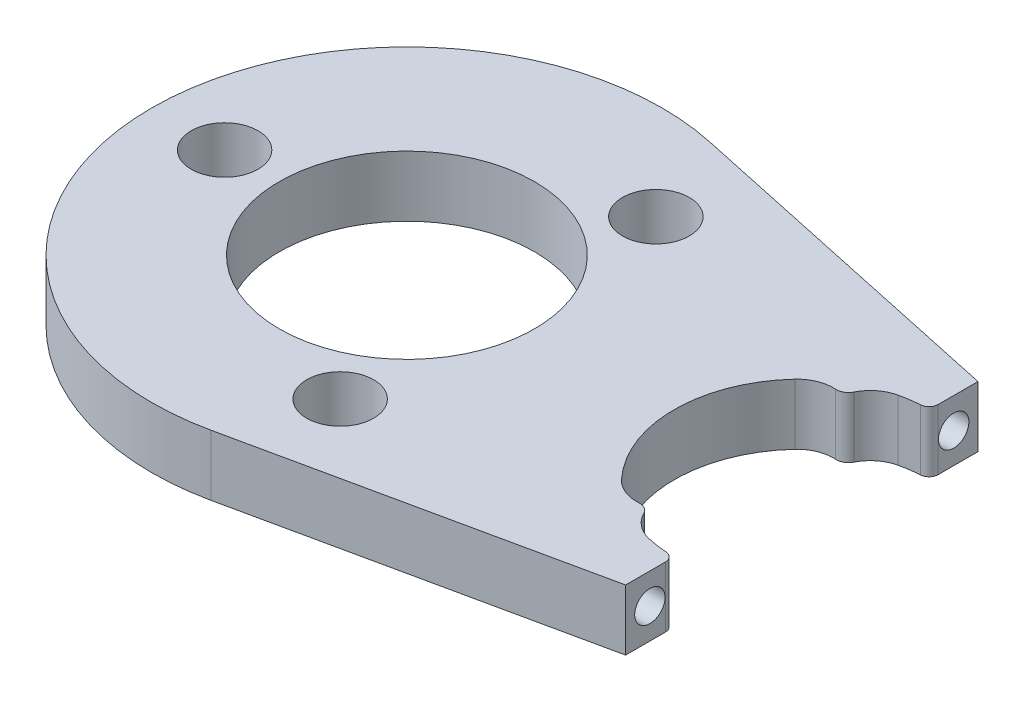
from build123d import *

# Parameters (mm, degrees)
SKETCH3_R                 = 10.5
BOSS_EXTRUDE1_DEPTH       = 2.5
M3X0_5_TAPPED_HOLE1_D     = 2.5
M3X0_5_TAPPED_HOLE1_DEPTH = 7.5
M3X0_5_TAPPED_HOLE1_TIP   = 0.751075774
FILLET1_R                 = 0.75
FILLET2_R                 = 3
M5_CLEARANCE_HOLE1_D      = 5.5
CIRPATTERN1_COUNT         = 3


with BuildPart() as part:
    # Sketch3 → Boss-Extrude1 (new, symmetric)
    with BuildSketch(Plane(origin=(0, 0, 0), x_dir=(1, 0, 0), z_dir=(0, 1, 0))):
        with BuildLine():
            Line((32.5, -10.5), (32.5, -14.5))
            Line((32.5, -14.5), (4.408806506, -20.531985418))
            ThreePointArc((4.408806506, -20.531985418), (-21, 0), (4.408806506, 20.531985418))
            Line((4.408806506, 20.531985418), (32.5, 14.5))
            Line((32.5, 14.5), (32.5, 10.5))
            ThreePointArc((32.5, 10.5), (30.268445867, 10.260125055), (28.138852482, 9.55146022))
            ThreePointArc((28.138852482, 9.55146022), (27.75, 8.227241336), (26.408766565, 8.55259465))
            ThreePointArc((26.408766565, 8.55259465), (22, 0), (26.408766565, -8.55259465))
            ThreePointArc((26.408766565, -8.55259465), (27.75, -8.227241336), (28.138852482, -9.55146022))
            ThreePointArc((28.138852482, -9.55146022), (30.268445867, -10.260125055), (32.5, -10.5))
        make_face()
        with Locations(Location((0, 0, 0), (0, 0, 270))):
            Circle(SKETCH3_R, mode=Mode.SUBTRACT)
    extrude(amount=BOSS_EXTRUDE1_DEPTH, both=True)

    # M3x0.5 Tapped Hole1
    with Locations(Plane(origin=(32.5, 0, 0), x_dir=(0, 0, -1), z_dir=(1, 0, 0))):
        with Locations((-12.5, 0), (12.5, 0)):
            Hole(M3X0_5_TAPPED_HOLE1_D / 2, depth=M3X0_5_TAPPED_HOLE1_DEPTH)
            with Locations((0, 0, -(M3X0_5_TAPPED_HOLE1_DEPTH + M3X0_5_TAPPED_HOLE1_TIP / 2))):  # 118° drill point
                Cone(0, M3X0_5_TAPPED_HOLE1_D / 2, M3X0_5_TAPPED_HOLE1_TIP, mode=Mode.SUBTRACT)

    # Fillet1
    fillet1_edges = [part.edges().sort_by_distance(p)[0] for p in [
        (32.5, 0, 10.5),
        (32.5, 0, -10.5),
    ]]
    fillet(fillet1_edges, radius=FILLET1_R)

    # Fillet2
    fillet2_edges = [part.edges().sort_by_distance(p)[0] for p in [
        (28.138852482, 0, -9.55146022),
        (26.408766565, 0, -8.55259465),
        (26.408766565, 0, 8.55259465),
        (28.138852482, 0, 9.55146022),
    ]]
    fillet(fillet2_edges, radius=FILLET2_R)

    # M5 Clearance Hole1 (through all)
    with Locations(Plane(origin=(0, 2.5, 0), x_dir=(1, 0, 0), z_dir=(0, 1, 0))):
        with Locations((-15, 0)):
            m5_clearance_hole1 = Hole(M5_CLEARANCE_HOLE1_D / 2)

    # CirPattern1: M5 Clearance Hole1 ×3 about axis
    cirpattern1_axis = Axis((0, 0, 0), (0, 1, 0))
    for i in range(1, CIRPATTERN1_COUNT):
        add(m5_clearance_hole1.rotate(cirpattern1_axis, i * 360 / CIRPATTERN1_COUNT), mode=Mode.SUBTRACT)


solid = part.part
